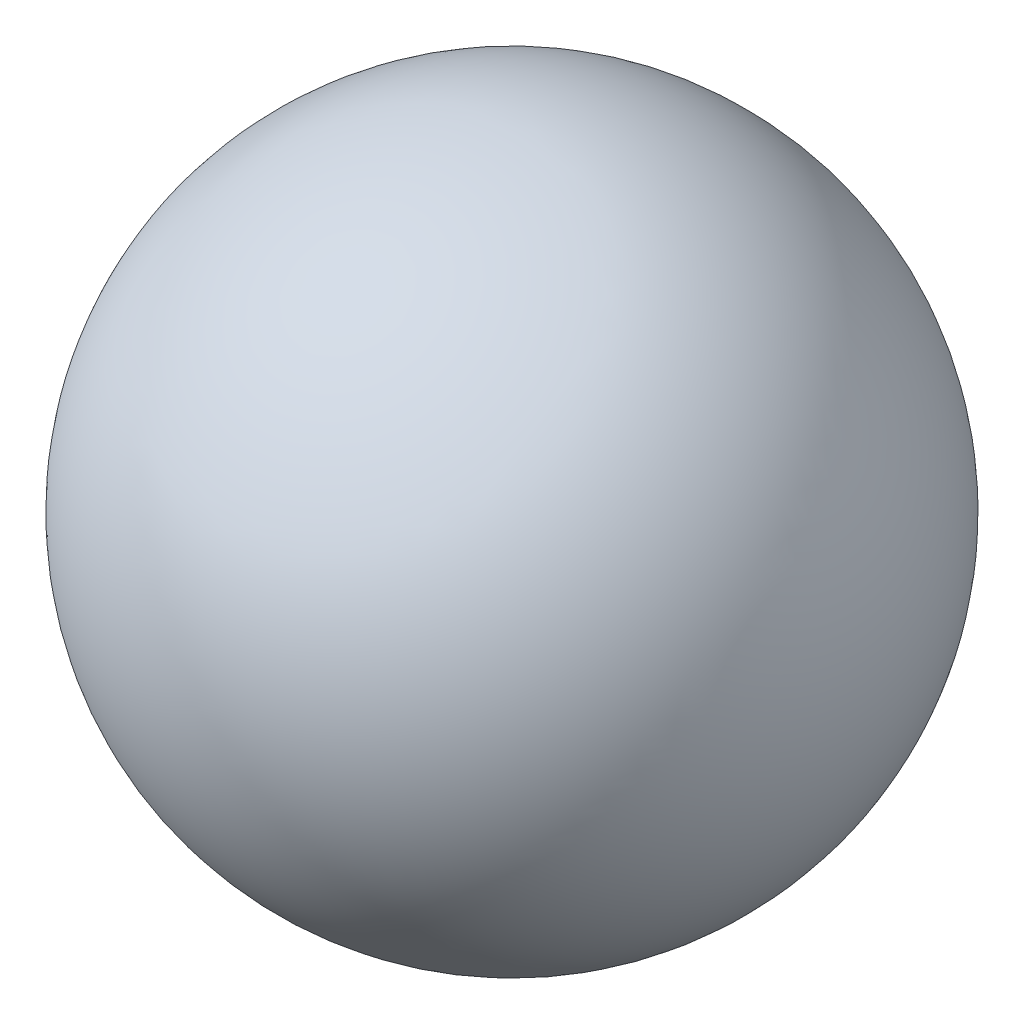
ISO-10303-21;
HEADER;
FILE_DESCRIPTION(('STEP AP214'),'2;1');
FILE_NAME('part.step','',(''),(''),'','','');
FILE_SCHEMA(('AUTOMOTIVE_DESIGN { 1 0 10303 214 1 1 1 1 }'));
ENDSEC;
DATA;
#1=APPLICATION_CONTEXT('core data for automotive mechanical design processes');
#2=APPLICATION_PROTOCOL_DEFINITION('international standard','automotive_design',2000,#1);
#3=PRODUCT_CONTEXT('',#1,'mechanical');
#4=PRODUCT('Part','Part','',(#3));
#5=PRODUCT_RELATED_PRODUCT_CATEGORY('part','',(#4));
#6=PRODUCT_DEFINITION_FORMATION('','',#4);
#7=PRODUCT_DEFINITION_CONTEXT('part definition',#1,'design');
#8=PRODUCT_DEFINITION('design','',#6,#7);
#9=PRODUCT_DEFINITION_SHAPE('','',#8);
#10=(LENGTH_UNIT() NAMED_UNIT(*) SI_UNIT(.MILLI.,.METRE.));
#11=(NAMED_UNIT(*) PLANE_ANGLE_UNIT() SI_UNIT($,.RADIAN.));
#12=(NAMED_UNIT(*) SI_UNIT($,.STERADIAN.) SOLID_ANGLE_UNIT());
#13=UNCERTAINTY_MEASURE_WITH_UNIT(LENGTH_MEASURE(1.E-05),#10,'distance_accuracy_value','');
#14=(GEOMETRIC_REPRESENTATION_CONTEXT(3) GLOBAL_UNCERTAINTY_ASSIGNED_CONTEXT((#13)) GLOBAL_UNIT_ASSIGNED_CONTEXT((#10,
#11,#12)) REPRESENTATION_CONTEXT('',''));
#15=CARTESIAN_POINT('',(0.,0.,0.));
#16=DIRECTION('',(0.,0.,1.));
#17=DIRECTION('',(1.,0.,0.));
#18=AXIS2_PLACEMENT_3D('',#15,#16,#17);
#19=CARTESIAN_POINT('',(0.,0.,0.));
#20=DIRECTION('',(-1.,0.,0.));
#21=DIRECTION('',(0.,1.,0.));
#22=AXIS2_PLACEMENT_3D('',#19,#20,#21);
#23=SPHERICAL_SURFACE('',#22,3.9);
#24=CARTESIAN_POINT('',(-3.9,0.,0.));
#25=VERTEX_POINT('',#24);
#26=VERTEX_LOOP('',#25);
#27=FACE_BOUND('',#26,.T.);
#28=ADVANCED_FACE('F29',(#27),#23,.T.);
#29=CLOSED_SHELL('',(#28));
#30=MANIFOLD_SOLID_BREP('B2',#29);
#31=ADVANCED_BREP_SHAPE_REPRESENTATION('',(#18,#30),#14);
#32=SHAPE_DEFINITION_REPRESENTATION(#9,#31);
ENDSEC;
END-ISO-10303-21;
